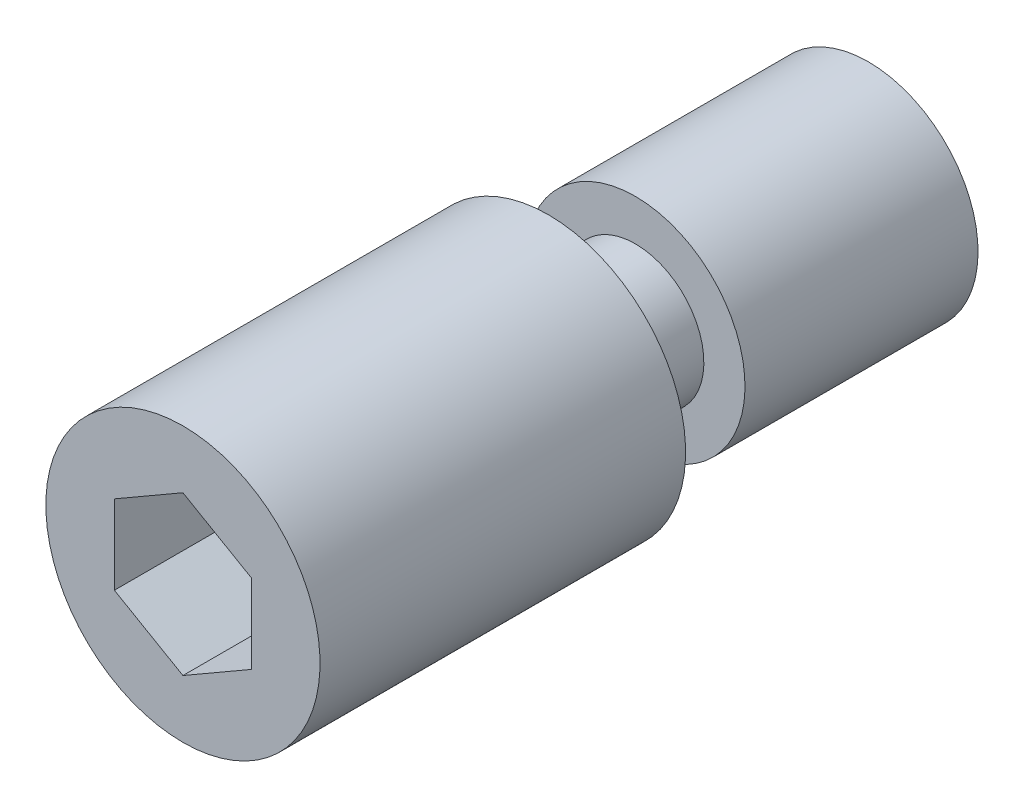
ISO-10303-21;
HEADER;
FILE_DESCRIPTION(('STEP AP214'),'2;1');
FILE_NAME('part.step','',(''),(''),'','','');
FILE_SCHEMA(('AUTOMOTIVE_DESIGN { 1 0 10303 214 1 1 1 1 }'));
ENDSEC;
DATA;
#1=APPLICATION_CONTEXT('core data for automotive mechanical design processes');
#2=APPLICATION_PROTOCOL_DEFINITION('international standard','automotive_design',2000,#1);
#3=PRODUCT_CONTEXT('',#1,'mechanical');
#4=PRODUCT('Part','Part','',(#3));
#5=PRODUCT_RELATED_PRODUCT_CATEGORY('part','',(#4));
#6=PRODUCT_DEFINITION_FORMATION('','',#4);
#7=PRODUCT_DEFINITION_CONTEXT('part definition',#1,'design');
#8=PRODUCT_DEFINITION('design','',#6,#7);
#9=PRODUCT_DEFINITION_SHAPE('','',#8);
#10=(LENGTH_UNIT() NAMED_UNIT(*) SI_UNIT(.MILLI.,.METRE.));
#11=(NAMED_UNIT(*) PLANE_ANGLE_UNIT() SI_UNIT($,.RADIAN.));
#12=(NAMED_UNIT(*) SI_UNIT($,.STERADIAN.) SOLID_ANGLE_UNIT());
#13=UNCERTAINTY_MEASURE_WITH_UNIT(LENGTH_MEASURE(1.E-05),#10,'distance_accuracy_value','');
#14=(GEOMETRIC_REPRESENTATION_CONTEXT(3) GLOBAL_UNCERTAINTY_ASSIGNED_CONTEXT((#13)) GLOBAL_UNIT_ASSIGNED_CONTEXT((#10,
#11,#12)) REPRESENTATION_CONTEXT('',''));
#15=CARTESIAN_POINT('',(0.,0.,0.));
#16=DIRECTION('',(0.,0.,1.));
#17=DIRECTION('',(1.,0.,0.));
#18=AXIS2_PLACEMENT_3D('',#15,#16,#17);
#19=CARTESIAN_POINT('',(0.,-3.,7.));
#20=DIRECTION('',(0.,0.,-1.));
#21=DIRECTION('',(0.,-1.,0.));
#22=AXIS2_PLACEMENT_3D('',#19,#20,#21);
#23=PLANE('',#22);
#24=CARTESIAN_POINT('',(0.,0.,7.));
#25=DIRECTION('',(0.,0.,1.));
#26=DIRECTION('',(0.,1.,0.));
#27=AXIS2_PLACEMENT_3D('',#24,#25,#26);
#28=CIRCLE('',#27,1.5);
#29=CARTESIAN_POINT('',(0.,1.5,7.));
#30=VERTEX_POINT('',#29);
#31=EDGE_CURVE('E115',#30,#30,#28,.T.);
#32=ORIENTED_EDGE('',*,*,#31,.T.);
#33=EDGE_LOOP('',(#32));
#34=FACE_BOUND('',#33,.T.);
#35=CARTESIAN_POINT('',(0.,0.,7.));
#36=DIRECTION('',(0.,0.,1.));
#37=DIRECTION('',(0.,1.,0.));
#38=AXIS2_PLACEMENT_3D('',#35,#36,#37);
#39=CIRCLE('',#38,3.);
#40=CARTESIAN_POINT('',(0.,3.,7.));
#41=VERTEX_POINT('',#40);
#42=EDGE_CURVE('E9',#41,#41,#39,.T.);
#43=ORIENTED_EDGE('',*,*,#42,.F.);
#44=EDGE_LOOP('',(#43));
#45=FACE_BOUND('',#44,.T.);
#46=ADVANCED_FACE('F14',(#34,#45),#23,.T.);
#47=CARTESIAN_POINT('',(0.,0.,20.));
#48=DIRECTION('',(0.,0.,1.));
#49=DIRECTION('',(0.,1.,0.));
#50=AXIS2_PLACEMENT_3D('',#47,#48,#49);
#51=CYLINDRICAL_SURFACE('',#50,3.);
#52=CARTESIAN_POINT('',(0.,0.,15.));
#53=DIRECTION('',(0.,0.,1.));
#54=DIRECTION('',(0.,1.,0.));
#55=AXIS2_PLACEMENT_3D('',#52,#53,#54);
#56=CIRCLE('',#55,3.);
#57=CARTESIAN_POINT('',(0.,3.,15.));
#58=VERTEX_POINT('',#57);
#59=EDGE_CURVE('E21',#58,#58,#56,.T.);
#60=ORIENTED_EDGE('',*,*,#59,.F.);
#61=EDGE_LOOP('',(#60));
#62=FACE_BOUND('',#61,.T.);
#63=ORIENTED_EDGE('',*,*,#42,.T.);
#64=EDGE_LOOP('',(#63));
#65=FACE_BOUND('',#64,.T.);
#66=ADVANCED_FACE('F136',(#62,#65),#51,.T.);
#67=CARTESIAN_POINT('',(0.,-3.,15.));
#68=DIRECTION('',(0.,0.,-1.));
#69=DIRECTION('',(0.,-1.,0.));
#70=AXIS2_PLACEMENT_3D('',#67,#68,#69);
#71=PLANE('',#70);
#72=DIRECTION('',(-0.866025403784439,-0.5,0.));
#73=VECTOR('',#72,1.);
#74=CARTESIAN_POINT('',(0.,1.73205080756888,15.));
#75=LINE('',#74,#73);
#76=CARTESIAN_POINT('',(0.,1.73205080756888,15.));
#77=VERTEX_POINT('',#76);
#78=CARTESIAN_POINT('',(-1.5,0.866025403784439,15.));
#79=VERTEX_POINT('',#78);
#80=EDGE_CURVE('E102',#77,#79,#75,.T.);
#81=ORIENTED_EDGE('',*,*,#80,.F.);
#82=DIRECTION('',(-0.866025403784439,0.5,0.));
#83=VECTOR('',#82,1.);
#84=CARTESIAN_POINT('',(1.5,0.86602540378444,15.));
#85=LINE('',#84,#83);
#86=CARTESIAN_POINT('',(1.5,0.86602540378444,15.));
#87=VERTEX_POINT('',#86);
#88=EDGE_CURVE('E28',#87,#77,#85,.T.);
#89=ORIENTED_EDGE('',*,*,#88,.F.);
#90=DIRECTION('',(0.,1.,0.));
#91=VECTOR('',#90,1.);
#92=CARTESIAN_POINT('',(1.5,-0.866025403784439,15.));
#93=LINE('',#92,#91);
#94=CARTESIAN_POINT('',(1.5,-0.866025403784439,15.));
#95=VERTEX_POINT('',#94);
#96=EDGE_CURVE('E111',#95,#87,#93,.T.);
#97=ORIENTED_EDGE('',*,*,#96,.F.);
#98=DIRECTION('',(0.866025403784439,0.5,0.));
#99=VECTOR('',#98,1.);
#100=CARTESIAN_POINT('',(0.,-1.73205080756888,15.));
#101=LINE('',#100,#99);
#102=CARTESIAN_POINT('',(0.,-1.73205080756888,15.));
#103=VERTEX_POINT('',#102);
#104=EDGE_CURVE('E109',#103,#95,#101,.T.);
#105=ORIENTED_EDGE('',*,*,#104,.F.);
#106=DIRECTION('',(0.866025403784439,-0.5,0.));
#107=VECTOR('',#106,1.);
#108=CARTESIAN_POINT('',(-1.5,-0.866025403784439,15.));
#109=LINE('',#108,#107);
#110=CARTESIAN_POINT('',(-1.5,-0.866025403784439,15.));
#111=VERTEX_POINT('',#110);
#112=EDGE_CURVE('E76',#111,#103,#109,.T.);
#113=ORIENTED_EDGE('',*,*,#112,.F.);
#114=DIRECTION('',(0.,-1.,0.));
#115=VECTOR('',#114,1.);
#116=CARTESIAN_POINT('',(-1.5,0.866025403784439,15.));
#117=LINE('',#116,#115);
#118=EDGE_CURVE('E105',#79,#111,#117,.T.);
#119=ORIENTED_EDGE('',*,*,#118,.F.);
#120=EDGE_LOOP('',(#81,#89,#97,#105,#113,#119));
#121=FACE_BOUND('',#120,.T.);
#122=ORIENTED_EDGE('',*,*,#59,.T.);
#123=EDGE_LOOP('',(#122));
#124=FACE_BOUND('',#123,.T.);
#125=ADVANCED_FACE('F134',(#121,#124),#71,.F.);
#126=CARTESIAN_POINT('',(0.,-2.4,0.));
#127=DIRECTION('',(0.,0.,-1.));
#128=DIRECTION('',(0.,-1.,0.));
#129=AXIS2_PLACEMENT_3D('',#126,#127,#128);
#130=PLANE('',#129);
#131=CARTESIAN_POINT('',(0.,0.,0.));
#132=DIRECTION('',(0.,0.,1.));
#133=DIRECTION('',(0.,1.,0.));
#134=AXIS2_PLACEMENT_3D('',#131,#132,#133);
#135=CIRCLE('',#134,2.4);
#136=CARTESIAN_POINT('',(0.,2.4,0.));
#137=VERTEX_POINT('',#136);
#138=EDGE_CURVE('E129',#137,#137,#135,.T.);
#139=ORIENTED_EDGE('',*,*,#138,.F.);
#140=EDGE_LOOP('',(#139));
#141=FACE_BOUND('',#140,.T.);
#142=ADVANCED_FACE('F167',(#141),#130,.T.);
#143=CARTESIAN_POINT('',(0.,0.,20.));
#144=DIRECTION('',(0.,0.,1.));
#145=DIRECTION('',(0.,1.,0.));
#146=AXIS2_PLACEMENT_3D('',#143,#144,#145);
#147=CYLINDRICAL_SURFACE('',#146,2.4);
#148=ORIENTED_EDGE('',*,*,#138,.T.);
#149=EDGE_LOOP('',(#148));
#150=FACE_BOUND('',#149,.T.);
#151=CARTESIAN_POINT('',(0.,0.,5.1));
#152=DIRECTION('',(0.,0.,1.));
#153=DIRECTION('',(0.,1.,0.));
#154=AXIS2_PLACEMENT_3D('',#151,#152,#153);
#155=CIRCLE('',#154,2.4);
#156=CARTESIAN_POINT('',(0.,2.4,5.1));
#157=VERTEX_POINT('',#156);
#158=EDGE_CURVE('E126',#157,#157,#155,.T.);
#159=ORIENTED_EDGE('',*,*,#158,.F.);
#160=EDGE_LOOP('',(#159));
#161=FACE_BOUND('',#160,.T.);
#162=ADVANCED_FACE('F160',(#150,#161),#147,.T.);
#163=CARTESIAN_POINT('',(0.,-1.5,5.1));
#164=DIRECTION('',(0.,0.,1.));
#165=DIRECTION('',(0.,1.,0.));
#166=AXIS2_PLACEMENT_3D('',#163,#164,#165);
#167=PLANE('',#166);
#168=ORIENTED_EDGE('',*,*,#158,.T.);
#169=EDGE_LOOP('',(#168));
#170=FACE_BOUND('',#169,.T.);
#171=CARTESIAN_POINT('',(0.,0.,5.1));
#172=DIRECTION('',(0.,0.,1.));
#173=DIRECTION('',(0.,1.,0.));
#174=AXIS2_PLACEMENT_3D('',#171,#172,#173);
#175=CIRCLE('',#174,1.5);
#176=CARTESIAN_POINT('',(0.,1.5,5.1));
#177=VERTEX_POINT('',#176);
#178=EDGE_CURVE('E123',#177,#177,#175,.T.);
#179=ORIENTED_EDGE('',*,*,#178,.F.);
#180=EDGE_LOOP('',(#179));
#181=FACE_BOUND('',#180,.T.);
#182=ADVANCED_FACE('F151',(#170,#181),#167,.T.);
#183=CARTESIAN_POINT('',(0.,0.,20.));
#184=DIRECTION('',(0.,0.,1.));
#185=DIRECTION('',(0.,1.,0.));
#186=AXIS2_PLACEMENT_3D('',#183,#184,#185);
#187=CYLINDRICAL_SURFACE('',#186,1.5);
#188=ORIENTED_EDGE('',*,*,#178,.T.);
#189=EDGE_LOOP('',(#188));
#190=FACE_BOUND('',#189,.T.);
#191=ORIENTED_EDGE('',*,*,#31,.F.);
#192=EDGE_LOOP('',(#191));
#193=FACE_BOUND('',#192,.T.);
#194=ADVANCED_FACE('F148',(#190,#193),#187,.T.);
#195=CARTESIAN_POINT('',(1.5,0.86602540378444,11.));
#196=DIRECTION('',(0.5,0.866025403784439,0.));
#197=DIRECTION('',(-0.866025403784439,0.5,0.));
#198=AXIS2_PLACEMENT_3D('',#195,#196,#197);
#199=PLANE('',#198);
#200=ORIENTED_EDGE('',*,*,#88,.T.);
#201=DIRECTION('',(0.,0.,1.));
#202=VECTOR('',#201,1.);
#203=CARTESIAN_POINT('',(0.,1.73205080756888,11.));
#204=LINE('',#203,#202);
#205=CARTESIAN_POINT('',(0.,1.73205080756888,11.));
#206=VERTEX_POINT('',#205);
#207=EDGE_CURVE('E58',#206,#77,#204,.T.);
#208=ORIENTED_EDGE('',*,*,#207,.F.);
#209=DIRECTION('',(-0.866025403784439,0.5,0.));
#210=VECTOR('',#209,1.);
#211=CARTESIAN_POINT('',(1.5,0.86602540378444,11.));
#212=LINE('',#211,#210);
#213=CARTESIAN_POINT('',(1.5,0.86602540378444,11.));
#214=VERTEX_POINT('',#213);
#215=EDGE_CURVE('E113',#214,#206,#212,.T.);
#216=ORIENTED_EDGE('',*,*,#215,.F.);
#217=DIRECTION('',(0.,0.,1.));
#218=VECTOR('',#217,1.);
#219=CARTESIAN_POINT('',(1.5,0.86602540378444,11.));
#220=LINE('',#219,#218);
#221=EDGE_CURVE('E36',#214,#87,#220,.T.);
#222=ORIENTED_EDGE('',*,*,#221,.T.);
#223=EDGE_LOOP('',(#200,#208,#216,#222));
#224=FACE_BOUND('',#223,.T.);
#225=ADVANCED_FACE('F150',(#224),#199,.F.);
#226=CARTESIAN_POINT('',(1.5,-0.866025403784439,11.));
#227=DIRECTION('',(1.,0.,0.));
#228=DIRECTION('',(0.,0.,-1.));
#229=AXIS2_PLACEMENT_3D('',#226,#227,#228);
#230=PLANE('',#229);
#231=ORIENTED_EDGE('',*,*,#96,.T.);
#232=ORIENTED_EDGE('',*,*,#221,.F.);
#233=DIRECTION('',(0.,1.,0.));
#234=VECTOR('',#233,1.);
#235=CARTESIAN_POINT('',(1.5,-0.866025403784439,11.));
#236=LINE('',#235,#234);
#237=CARTESIAN_POINT('',(1.5,-0.866025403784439,11.));
#238=VERTEX_POINT('',#237);
#239=EDGE_CURVE('E88',#238,#214,#236,.T.);
#240=ORIENTED_EDGE('',*,*,#239,.F.);
#241=DIRECTION('',(0.,0.,1.));
#242=VECTOR('',#241,1.);
#243=CARTESIAN_POINT('',(1.5,-0.866025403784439,11.));
#244=LINE('',#243,#242);
#245=EDGE_CURVE('E80',#238,#95,#244,.T.);
#246=ORIENTED_EDGE('',*,*,#245,.T.);
#247=EDGE_LOOP('',(#231,#232,#240,#246));
#248=FACE_BOUND('',#247,.T.);
#249=ADVANCED_FACE('F158',(#248),#230,.F.);
#250=CARTESIAN_POINT('',(0.,-1.73205080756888,11.));
#251=DIRECTION('',(0.5,-0.866025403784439,0.));
#252=DIRECTION('',(0.866025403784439,0.5,0.));
#253=AXIS2_PLACEMENT_3D('',#250,#251,#252);
#254=PLANE('',#253);
#255=ORIENTED_EDGE('',*,*,#104,.T.);
#256=ORIENTED_EDGE('',*,*,#245,.F.);
#257=DIRECTION('',(0.866025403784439,0.5,0.));
#258=VECTOR('',#257,1.);
#259=CARTESIAN_POINT('',(0.,-1.73205080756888,11.));
#260=LINE('',#259,#258);
#261=CARTESIAN_POINT('',(0.,-1.73205080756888,11.));
#262=VERTEX_POINT('',#261);
#263=EDGE_CURVE('E84',#262,#238,#260,.T.);
#264=ORIENTED_EDGE('',*,*,#263,.F.);
#265=DIRECTION('',(0.,0.,1.));
#266=VECTOR('',#265,1.);
#267=CARTESIAN_POINT('',(0.,-1.73205080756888,11.));
#268=LINE('',#267,#266);
#269=EDGE_CURVE('E69',#262,#103,#268,.T.);
#270=ORIENTED_EDGE('',*,*,#269,.T.);
#271=EDGE_LOOP('',(#255,#256,#264,#270));
#272=FACE_BOUND('',#271,.T.);
#273=ADVANCED_FACE('F85',(#272),#254,.F.);
#274=CARTESIAN_POINT('',(-1.5,-0.866025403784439,11.));
#275=DIRECTION('',(-0.5,-0.866025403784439,0.));
#276=DIRECTION('',(0.866025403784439,-0.5,0.));
#277=AXIS2_PLACEMENT_3D('',#274,#275,#276);
#278=PLANE('',#277);
#279=ORIENTED_EDGE('',*,*,#112,.T.);
#280=ORIENTED_EDGE('',*,*,#269,.F.);
#281=DIRECTION('',(0.866025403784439,-0.5,0.));
#282=VECTOR('',#281,1.);
#283=CARTESIAN_POINT('',(-1.5,-0.866025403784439,11.));
#284=LINE('',#283,#282);
#285=CARTESIAN_POINT('',(-1.5,-0.866025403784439,11.));
#286=VERTEX_POINT('',#285);
#287=EDGE_CURVE('E73',#286,#262,#284,.T.);
#288=ORIENTED_EDGE('',*,*,#287,.F.);
#289=DIRECTION('',(0.,0.,1.));
#290=VECTOR('',#289,1.);
#291=CARTESIAN_POINT('',(-1.5,-0.866025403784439,11.));
#292=LINE('',#291,#290);
#293=EDGE_CURVE('E81',#286,#111,#292,.T.);
#294=ORIENTED_EDGE('',*,*,#293,.T.);
#295=EDGE_LOOP('',(#279,#280,#288,#294));
#296=FACE_BOUND('',#295,.T.);
#297=ADVANCED_FACE('F71',(#296),#278,.F.);
#298=CARTESIAN_POINT('',(-1.5,0.866025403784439,11.));
#299=DIRECTION('',(-1.,0.,0.));
#300=DIRECTION('',(0.,-1.,0.));
#301=AXIS2_PLACEMENT_3D('',#298,#299,#300);
#302=PLANE('',#301);
#303=ORIENTED_EDGE('',*,*,#118,.T.);
#304=ORIENTED_EDGE('',*,*,#293,.F.);
#305=DIRECTION('',(0.,-1.,0.));
#306=VECTOR('',#305,1.);
#307=CARTESIAN_POINT('',(-1.5,0.866025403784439,11.));
#308=LINE('',#307,#306);
#309=CARTESIAN_POINT('',(-1.5,0.866025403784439,11.));
#310=VERTEX_POINT('',#309);
#311=EDGE_CURVE('E94',#310,#286,#308,.T.);
#312=ORIENTED_EDGE('',*,*,#311,.F.);
#313=DIRECTION('',(0.,0.,1.));
#314=VECTOR('',#313,1.);
#315=CARTESIAN_POINT('',(-1.5,0.866025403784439,11.));
#316=LINE('',#315,#314);
#317=EDGE_CURVE('E118',#310,#79,#316,.T.);
#318=ORIENTED_EDGE('',*,*,#317,.T.);
#319=EDGE_LOOP('',(#303,#304,#312,#318));
#320=FACE_BOUND('',#319,.T.);
#321=ADVANCED_FACE('F192',(#320),#302,.F.);
#322=CARTESIAN_POINT('',(0.,1.73205080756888,11.));
#323=DIRECTION('',(-0.5,0.866025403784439,0.));
#324=DIRECTION('',(-0.866025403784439,-0.5,0.));
#325=AXIS2_PLACEMENT_3D('',#322,#323,#324);
#326=PLANE('',#325);
#327=ORIENTED_EDGE('',*,*,#80,.T.);
#328=ORIENTED_EDGE('',*,*,#317,.F.);
#329=DIRECTION('',(-0.866025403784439,-0.5,0.));
#330=VECTOR('',#329,1.);
#331=CARTESIAN_POINT('',(0.,1.73205080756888,11.));
#332=LINE('',#331,#330);
#333=EDGE_CURVE('E96',#206,#310,#332,.T.);
#334=ORIENTED_EDGE('',*,*,#333,.F.);
#335=ORIENTED_EDGE('',*,*,#207,.T.);
#336=EDGE_LOOP('',(#327,#328,#334,#335));
#337=FACE_BOUND('',#336,.T.);
#338=ADVANCED_FACE('F180',(#337),#326,.F.);
#339=CARTESIAN_POINT('',(0.,1.73205080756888,11.));
#340=DIRECTION('',(0.,0.,1.));
#341=DIRECTION('',(1.,0.,0.));
#342=AXIS2_PLACEMENT_3D('',#339,#340,#341);
#343=PLANE('',#342);
#344=ORIENTED_EDGE('',*,*,#215,.T.);
#345=ORIENTED_EDGE('',*,*,#333,.T.);
#346=ORIENTED_EDGE('',*,*,#311,.T.);
#347=ORIENTED_EDGE('',*,*,#287,.T.);
#348=ORIENTED_EDGE('',*,*,#263,.T.);
#349=ORIENTED_EDGE('',*,*,#239,.T.);
#350=EDGE_LOOP('',(#344,#345,#346,#347,#348,#349));
#351=FACE_BOUND('',#350,.T.);
#352=ADVANCED_FACE('F91',(#351),#343,.T.);
#353=CLOSED_SHELL('',(#46,#66,#125,#142,#162,#182,#194,#225,#249,#273,#297,#321,#338,#352));
#354=MANIFOLD_SOLID_BREP('B1',#353);
#355=ADVANCED_BREP_SHAPE_REPRESENTATION('',(#18,#354),#14);
#356=SHAPE_DEFINITION_REPRESENTATION(#9,#355);
ENDSEC;
END-ISO-10303-21;
